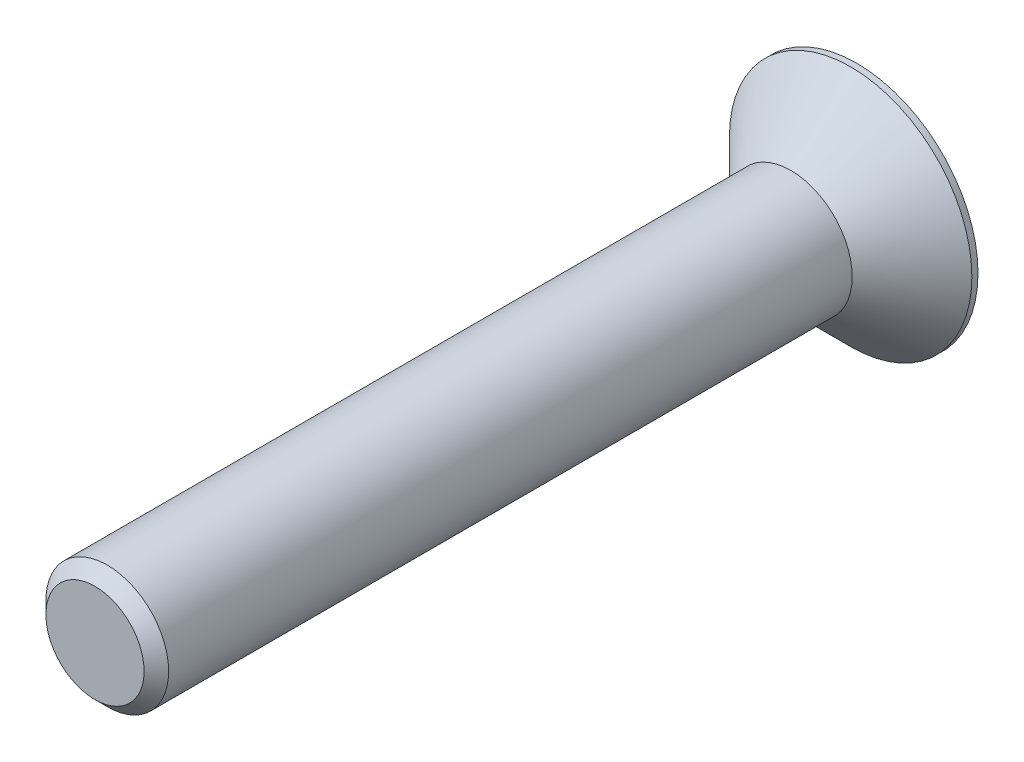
from build123d import *

# Parameters (mm, degrees)
FENTE1_DEPTH    = 3.8
ESQUISSE3_W     = 4
ESQUISSE3_H     = 45.35
CHANFREIN1_SIZE = 0.8


with BuildPart() as part:
    # Esquisse1 → Base-R_volution (revolve)
    with BuildSketch(Plane(origin=(0, 0, 0), x_dir=(1, 0, 0), z_dir=(0, 1, 0)), mode=Mode.PRIVATE) as base_r_volution_sk:
        Polygon((4, 0), (7.9, 3.9), (7.9, 4.3), (0, 4.3), (0, 3.9), (0, 0), align=None)
    revolve(base_r_volution_sk.sketch.rotate(Axis((0, 0, 0), (0, 0, -1)), 180), axis=Axis((0, 0, 0), (0, 0, -1)))

    # Esquisse2 → fente1 (cut)
    with BuildSketch(Plane.XY.offset(-4.3)):
        Polygon((2.5, -1.443375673), (2.5, 1.443375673), (0, 2.886751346), (-2.5, 1.443375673), (-2.5, -1.443375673), (0, -2.886751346), align=None)
    extrude(amount=FENTE1_DEPTH, mode=Mode.SUBTRACT)

    # Esquisse3 → Boss.-R_vol.1 (revolve)
    with BuildSketch(Plane(origin=(0, 0, 0), x_dir=(1, 0, 0), z_dir=(0, 1, 0))):
        with Locations((2, -22.675)):
            Rectangle(ESQUISSE3_W, ESQUISSE3_H)
    revolve(axis=Axis((0, 0, 0), (0, 0, 1)))

    # Chanfrein1
    chanfrein1_edges = [part.edges().sort_by_distance(p)[0] for p in [
        (-4, 0, 45.35),
    ]]
    chamfer(chanfrein1_edges, length=CHANFREIN1_SIZE)


solid = part.part
